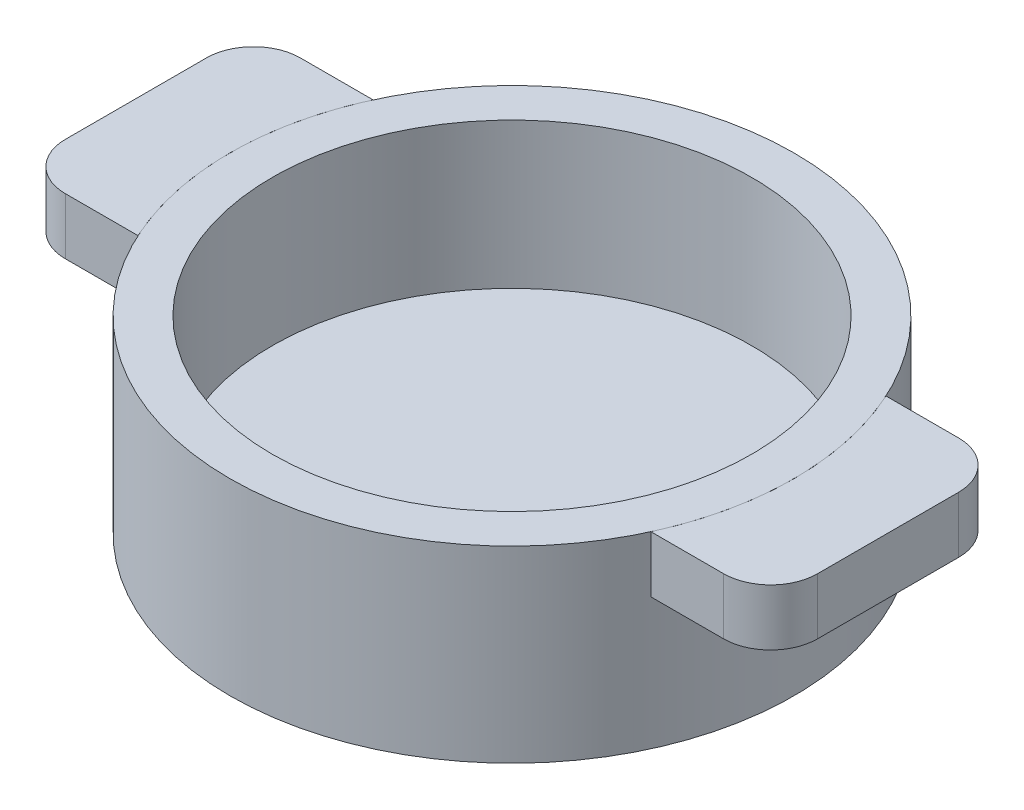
from build123d import *

# Parameters (mm, degrees)
SKETCH1_R             = 60
BOSS_EXTRUDE1_DEPTH   = 40
SHELL1_T              = -9
BOSS_EXTRUDE2_DEPTH   = 12
BOSS_EXTRUDE2_2_DEPTH = 12


with BuildPart() as part:
    # Sketch1 → Boss-Extrude1 (new body)
    with BuildSketch(Plane(origin=(0, 0, 0), x_dir=(1, 0, 0), z_dir=(0, 1, 0))):
        with Locations(Location((0, 0, 0), (0, 0, 270))):
            Circle(SKETCH1_R)
    extrude(amount=BOSS_EXTRUDE1_DEPTH)

    # Shell1
    shell1_openings = [part.faces().sort_by_distance(p)[0] for p in [
        (0, 40, 0),
    ]]
    offset(amount=SHELL1_T, openings=shell1_openings, kind=Kind.INTERSECTION)


with BuildPart() as body_2:
    # Sketch2 → Boss-Extrude2 (new body)
    with BuildSketch(Plane(origin=(0, 40, 0), x_dir=(1, 0, 0), z_dir=(0, 1, 0))):
        with BuildLine():
            Line((54.543560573, 25), (70, 25))
            ThreePointArc((70, 25), (77.071067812, 22.071067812), (80, 15))
            Line((80, 15), (80, -15))
            ThreePointArc((80, -15), (77.071067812, -22.071067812), (70, -25))
            Line((70, -25), (54.543560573, -25))
            ThreePointArc((54.543560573, -25), (60, 0), (54.543560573, 25))
        make_face()
    extrude(amount=-BOSS_EXTRUDE2_DEPTH)


with BuildPart() as body_3:
    # Sketch2 → Boss-Extrude2 2 (new body)
    with BuildSketch(Plane(origin=(0, 40, 0), x_dir=(1, 0, 0), z_dir=(0, 1, 0))):
        with BuildLine():
            Line((-70, 25), (-54.543560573, 25))
            ThreePointArc((-54.543560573, 25), (-60, 0), (-54.543560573, -25))
            Line((-54.543560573, -25), (-70, -25))
            ThreePointArc((-70, -25), (-77.071067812, -22.071067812), (-80, -15))
            Line((-80, -15), (-80, 15))
            ThreePointArc((-80, 15), (-77.071067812, 22.071067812), (-70, 25))
        make_face()
    extrude(amount=-BOSS_EXTRUDE2_2_DEPTH)


solid = Compound([part.part, body_2.part, body_3.part])
